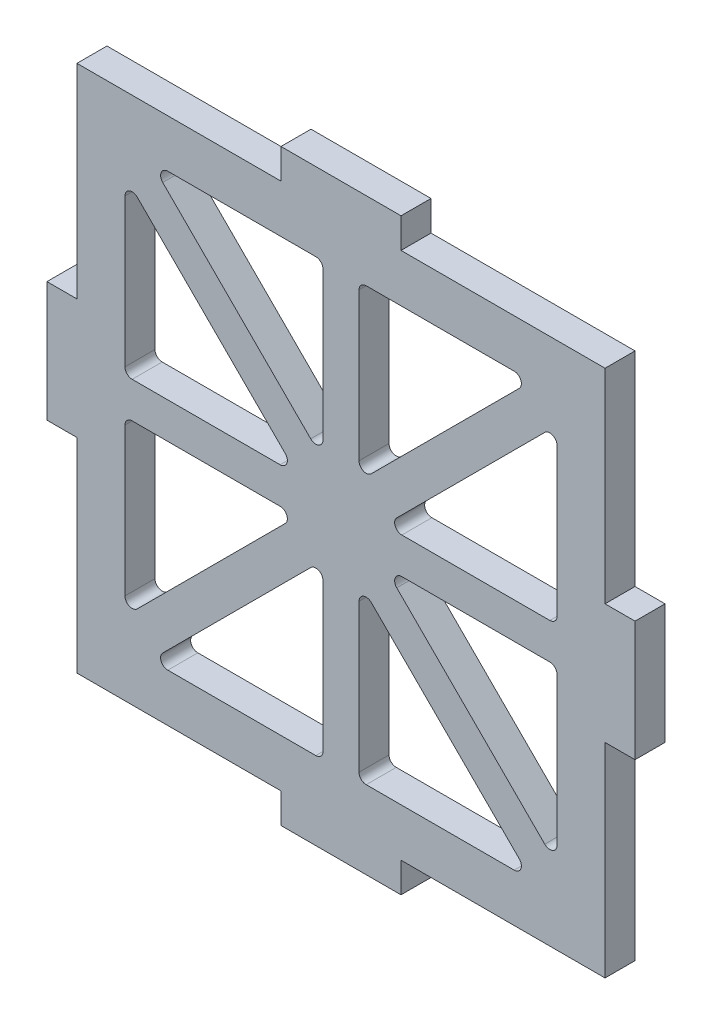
from build123d import *

# Parameters (mm, degrees)
SKETCH_1_W          = 44
SKETCH_1_H          = 44
EXTRUDE_1_DEPTH     = 2.5
SKETCH_2_W          = 10
SKETCH_2_H          = 2.5
SKETCH_2_W_2        = 2.5
SKETCH_2_H_2        = 10
EXTRUDE_2_DEPTH     = 2.5
CUT_EXTRUDE_1_DEPTH = 2.5


with BuildPart() as part:
    # Sketch 1 → Extrude 1 (new body)
    with BuildSketch(Plane.XY):
        with Locations((0, 22)):
            Rectangle(SKETCH_1_W, SKETCH_1_H)
    extrude(amount=EXTRUDE_1_DEPTH)

    # Sketch 2 → Extrude 2 (add)
    with BuildSketch(Plane.XY.offset(2.5)):
        with Locations((0, -1.25)):
            Rectangle(SKETCH_2_W, SKETCH_2_H)
        with Locations((0, 45.25)):
            Rectangle(SKETCH_2_W, SKETCH_2_H)
        with Locations((23.25, 22)):
            Rectangle(SKETCH_2_W_2, SKETCH_2_H_2)
        with Locations((-23.25, 22)):
            Rectangle(SKETCH_2_W_2, SKETCH_2_H_2)
    extrude(amount=-EXTRUDE_2_DEPTH)

    # Sketch 3 → Cut-Extrude 1 (cut)
    with BuildSketch(Plane.XY.offset(2.5)):
        with BuildLine():
            Line((-18, 36.430151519), (-18, 24.1))
            ThreePointArc((-18, 24.1), (-17.824264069, 23.675735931), (-17.4, 23.5))
            Line((-17.4, 23.5), (-5.069848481, 23.5))
            ThreePointArc((-5.069848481, 23.5), (-4.515520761, 23.870389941), (-4.645584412, 24.524264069))
            Line((-4.645584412, 24.524264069), (-16.975735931, 36.854415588))
            ThreePointArc((-16.975735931, 36.854415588), (-17.629610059, 36.984479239), (-18, 36.430151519))
        make_face()
        with BuildLine():
            Line((-4.645584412, 19.475735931), (-16.975735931, 7.145584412))
            ThreePointArc((-16.975735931, 7.145584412), (-17.629610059, 7.015520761), (-18, 7.569848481))
            Line((-18, 7.569848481), (-18, 19.9))
            ThreePointArc((-18, 19.9), (-17.824264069, 20.324264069), (-17.4, 20.5))
            Line((-17.4, 20.5), (-5.069848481, 20.5))
            ThreePointArc((-5.069848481, 20.5), (-4.515520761, 20.129610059), (-4.645584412, 19.475735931))
        make_face()
        with BuildLine():
            Line((18, 7.569848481), (18, 19.9))
            ThreePointArc((18, 19.9), (17.824264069, 20.324264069), (17.4, 20.5))
            Line((17.4, 20.5), (5.069848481, 20.5))
            ThreePointArc((5.069848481, 20.5), (4.515520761, 20.129610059), (4.645584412, 19.475735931))
            Line((4.645584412, 19.475735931), (16.975735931, 7.145584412))
            ThreePointArc((16.975735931, 7.145584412), (17.629610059, 7.015520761), (18, 7.569848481))
        make_face()
        with BuildLine():
            Line((4.645584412, 24.524264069), (16.975735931, 36.854415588))
            ThreePointArc((16.975735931, 36.854415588), (17.629610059, 36.984479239), (18, 36.430151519))
            Line((18, 36.430151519), (18, 24.1))
            ThreePointArc((18, 24.1), (17.824264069, 23.675735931), (17.4, 23.5))
            Line((17.4, 23.5), (5.069848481, 23.5))
            ThreePointArc((5.069848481, 23.5), (4.515520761, 23.870389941), (4.645584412, 24.524264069))
        make_face()
        with BuildLine():
            Line((-14.430151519, 40), (-2.1, 40))
            ThreePointArc((-2.1, 40), (-1.675735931, 39.824264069), (-1.5, 39.4))
            Line((-1.5, 39.4), (-1.5, 27.069848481))
            ThreePointArc((-1.5, 27.069848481), (-1.870389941, 26.515520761), (-2.524264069, 26.645584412))
            Line((-2.524264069, 26.645584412), (-14.854415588, 38.975735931))
            ThreePointArc((-14.854415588, 38.975735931), (-14.984479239, 39.629610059), (-14.430151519, 40))
        make_face()
        with BuildLine():
            Line((2.524264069, 26.645584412), (14.854415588, 38.975735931))
            ThreePointArc((14.854415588, 38.975735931), (14.984479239, 39.629610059), (14.430151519, 40))
            Line((14.430151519, 40), (2.1, 40))
            ThreePointArc((2.1, 40), (1.675735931, 39.824264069), (1.5, 39.4))
            Line((1.5, 39.4), (1.5, 27.069848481))
            ThreePointArc((1.5, 27.069848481), (1.870389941, 26.515520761), (2.524264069, 26.645584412))
        make_face()
        with BuildLine():
            Line((14.430151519, 4), (2.1, 4))
            ThreePointArc((2.1, 4), (1.675735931, 4.175735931), (1.5, 4.6))
            Line((1.5, 4.6), (1.5, 16.930151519))
            ThreePointArc((1.5, 16.930151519), (1.870389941, 17.484479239), (2.524264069, 17.354415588))
            Line((2.524264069, 17.354415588), (14.854415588, 5.024264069))
            ThreePointArc((14.854415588, 5.024264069), (14.984479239, 4.370389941), (14.430151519, 4))
        make_face()
        with BuildLine():
            Line((-2.524264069, 17.354415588), (-14.854415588, 5.024264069))
            ThreePointArc((-14.854415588, 5.024264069), (-14.984479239, 4.370389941), (-14.430151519, 4))
            Line((-14.430151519, 4), (-2.1, 4))
            ThreePointArc((-2.1, 4), (-1.675735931, 4.175735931), (-1.5, 4.6))
            Line((-1.5, 4.6), (-1.5, 16.930151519))
            ThreePointArc((-1.5, 16.930151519), (-1.870389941, 17.484479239), (-2.524264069, 17.354415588))
        make_face()
    extrude(amount=-CUT_EXTRUDE_1_DEPTH, mode=Mode.SUBTRACT)


solid = part.part
